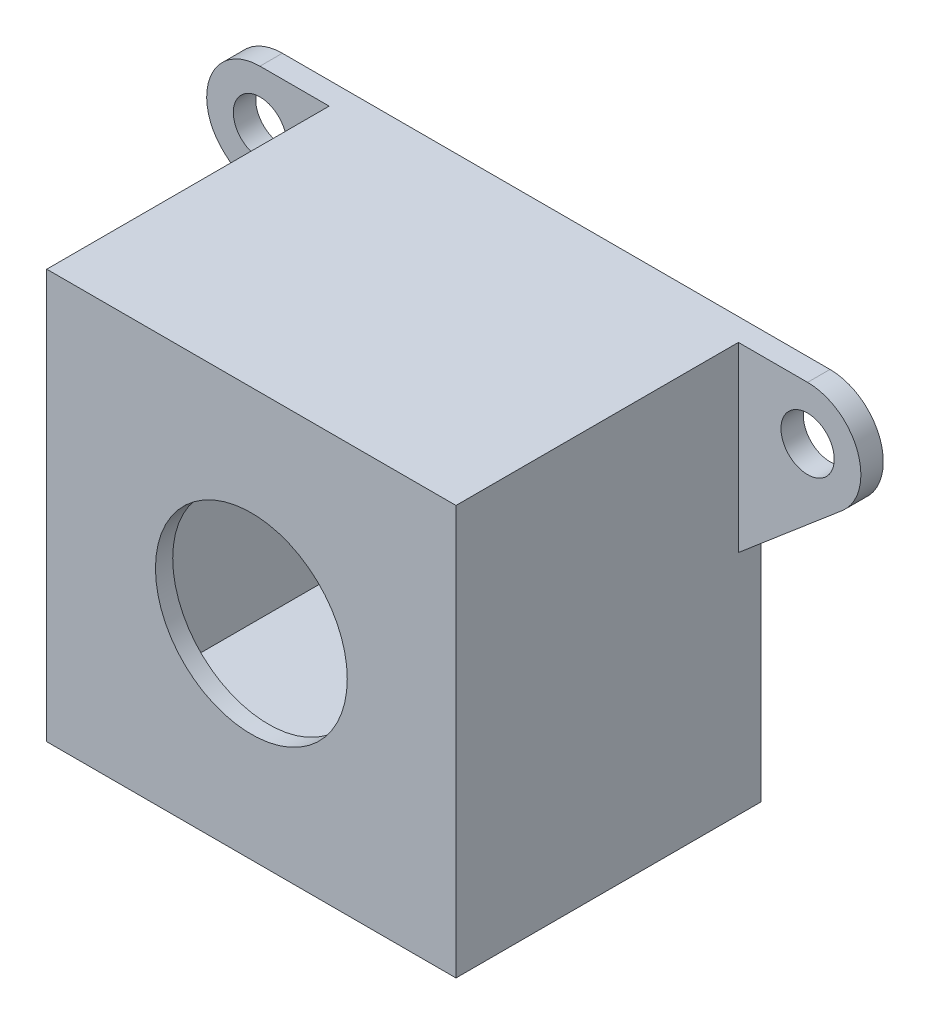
from build123d import *

# Parameters (mm, degrees)
SKETCH1_R           = 3.175
BOSS_EXTRUDE1_DEPTH = 2.667
SKETCH2_W           = 48.768
SKETCH2_H           = 48.768
SKETCH2_W_2         = 42.418
SKETCH2_H_2         = 42.418
BOSS_EXTRUDE2_DEPTH = 31.5976
SKETCH3_W           = 48.768
SKETCH3_H           = 48.768
SKETCH3_R           = 11.43
BOSS_EXTRUDE3_DEPTH = 2.0574


with BuildPart() as part:
    # Sketch1 → Boss-Extrude1 (new body)
    with BuildSketch(Plane.XY):
        with BuildLine():
            ThreePointArc((-35.94612446, 7.204686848), (-37.795306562, 14.234113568), (-31.834894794, 18.394138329))
            Line((-31.834894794, 18.394138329), (33.424041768, 18.394138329))
            ThreePointArc((33.424041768, 18.394138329), (39.384453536, 14.234113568), (37.535271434, 7.204686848))
            Line((37.535271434, 7.204686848), (25.178573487, -3.292623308))
            Line((25.178573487, -3.292623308), (25.178573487, -30.373861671))
            Line((25.178573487, -30.373861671), (-23.589426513, -30.373861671))
            Line((-23.589426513, -30.373861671), (-23.589426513, -3.292623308))
            Line((-23.589426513, -3.292623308), (-35.94612446, 7.204686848))
        make_face()
        with Locations((-31.834894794, 12.044138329)):
            Circle(SKETCH1_R, mode=Mode.SUBTRACT)
        with Locations((33.424041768, 12.044138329)):
            Circle(SKETCH1_R, mode=Mode.SUBTRACT)
        Polygon((22.003573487, 15.219138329), (0.794573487, 15.219138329), (-20.414426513, 15.219138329), (-20.414426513, -27.198861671), (0.794573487, -27.198861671), (22.003573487, -27.198861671), align=None, mode=Mode.SUBTRACT)
    extrude(amount=BOSS_EXTRUDE1_DEPTH)

    # Sketch2 → Boss-Extrude2 (add)
    with BuildSketch(Plane.XY.offset(2.667)):
        with Locations((0.794573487, -5.989861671)):
            Rectangle(SKETCH2_W, SKETCH2_H)
        with Locations((0.794573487, -5.989861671)):
            Rectangle(SKETCH2_W_2, SKETCH2_H_2, mode=Mode.SUBTRACT)
    extrude(amount=BOSS_EXTRUDE2_DEPTH)

    # Sketch3 → Boss-Extrude3 (add)
    with BuildSketch(Plane.XY.offset(34.2646)):
        with Locations((0.794573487, -5.989861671)):
            Rectangle(SKETCH3_W, SKETCH3_H)
        with Locations((0.794573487, -5.989861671)):
            Circle(SKETCH3_R, mode=Mode.SUBTRACT)
    extrude(amount=BOSS_EXTRUDE3_DEPTH)


solid = part.part
